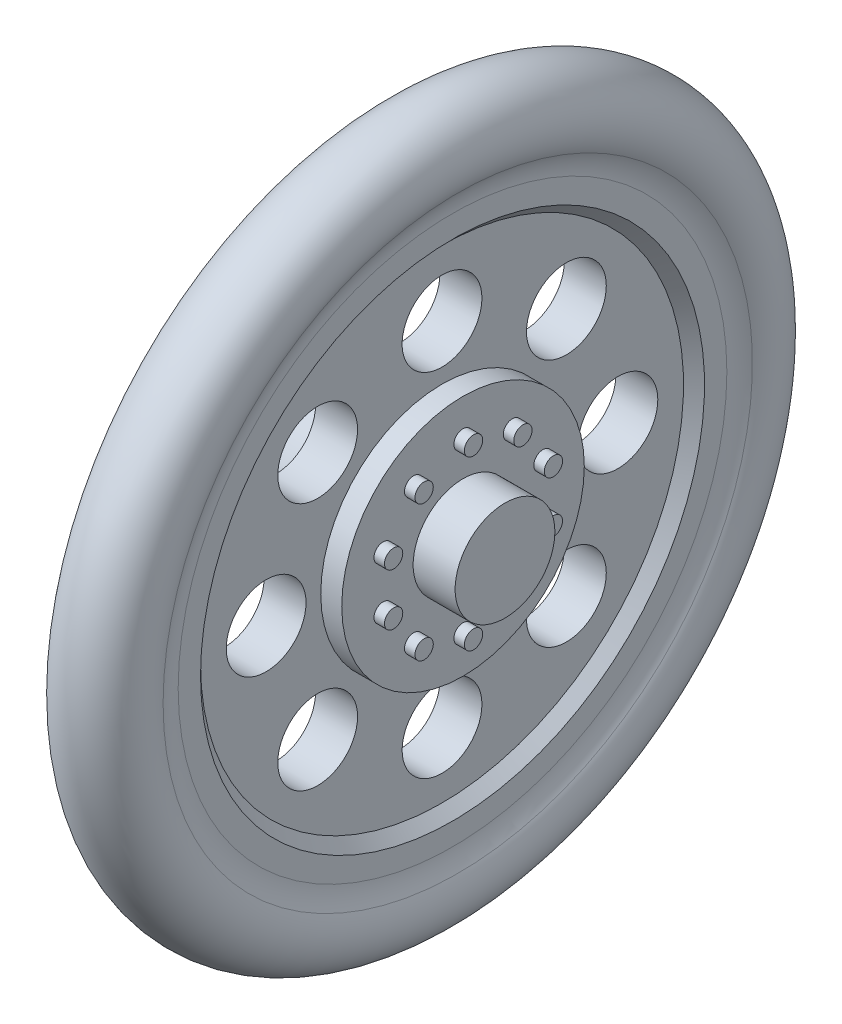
from build123d import *

# Parameters (mm, degrees)
FILLET1_R          = 2
SKETCH2_R          = 5.775
EXTRUDE1_DEPTH     = 1
SKETCH3_R          = 2.375
EXTRUDE2_DEPTH     = 2
SKETCH4_R          = 0.435
EXTRUDE3_DEPTH     = 0.5
CIRPATTERN1_COUNT  = 10
SKETCH5_R          = 1.9
CUT_EXTRUDE1_DEPTH = 26.850532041
CIRPATTERN2_COUNT  = 8
SKETCH6_R          = 1.63
CUT_EXTRUDE2_DEPTH = 10.9125


with BuildPart() as part:
    # Sketch1 → Revolve1 (revolve)
    with BuildSketch(Plane.XY, mode=Mode.PRIVATE) as revolve1_sk:
        with BuildLine():
            Line((9.5, 0), (0, 0))
            Line((0, 0), (0, 3.1))
            Line((0, 3.1), (7.5, 3.1))
            Line((7.5, 3.1), (7.5, 11.5))
            Line((7.5, 11.5), (7, 12))
            Line((7, 12), (7, 13.677124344))
            ThreePointArc((7, 13.677124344), (8.5, 17), (10, 13.677124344))
            Line((10, 13.677124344), (10, 12))
            Line((10, 12), (9.5, 11.5))
            Line((9.5, 11.5), (9.5, 0))
        make_face()
    revolve(revolve1_sk.sketch.rotate(Axis((0, 0, 0), (1, 0, 0)), 90), axis=Axis((0, 0, 0), (1, 0, 0)))

    # Fillet1
    fillet1_edges = [part.edges().sort_by_distance(p)[0] for p in [
        (7, 0, -13.677124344),
        (10, 0, -13.677124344),
    ]]
    fillet(fillet1_edges, radius=FILLET1_R)

    # Sketch2 → Extrude1 (add)
    with BuildSketch(Plane(origin=(9.5, 0, 0), x_dir=(0, 0, -1), z_dir=(1, 0, 0))):
        with Locations(Location((0, 0, 0), (0, 0, 180))):
            Circle(SKETCH2_R)
    extrude(amount=EXTRUDE1_DEPTH)

    # Sketch3 → Extrude2 (add)
    with BuildSketch(Plane(origin=(10.5, 0, 0), x_dir=(0, 0, -1), z_dir=(1, 0, 0))):
        Circle(SKETCH3_R)
    extrude(amount=EXTRUDE2_DEPTH)

    # Sketch4 → Extrude3 (add)
    with BuildSketch(Plane(origin=(10.5, 0, 0), x_dir=(0, 0, -1), z_dir=(1, 0, 0))):
        with Locations((0, 4)):
            Circle(SKETCH4_R)
    extrude3 = extrude(amount=EXTRUDE3_DEPTH)

    # CirPattern1: Extrude3 ×10 about axis
    cirpattern1_axis = Axis((0, 0, 0), (1, 0, 0))
    for i in range(1, CIRPATTERN1_COUNT):
        add(extrude3.rotate(cirpattern1_axis, i * 360 / CIRPATTERN1_COUNT))

    # Sketch5 → Cut-Extrude1 (cut, through all)
    with BuildSketch(Plane(origin=(9.5, 0, 0), x_dir=(0, 0, -1), z_dir=(1, 0, 0))):
        with Locations((0, 8.375)):
            Circle(SKETCH5_R)
    cut_extrude1 = extrude(amount=-CUT_EXTRUDE1_DEPTH, mode=Mode.SUBTRACT)

    # CirPattern2: Cut-Extrude1 ×8 about axis
    cirpattern2_axis = Axis((0, 0, 0), (1, 0, 0))
    for i in range(1, CIRPATTERN2_COUNT):
        add(cut_extrude1.rotate(cirpattern2_axis, i * 360 / CIRPATTERN2_COUNT), mode=Mode.SUBTRACT)

    # Sketch6 → Cut-Extrude2 (cut)
    with BuildSketch(Plane.ZY):
        Circle(SKETCH6_R)
    extrude(amount=-CUT_EXTRUDE2_DEPTH, mode=Mode.SUBTRACT)


solid = part.part
